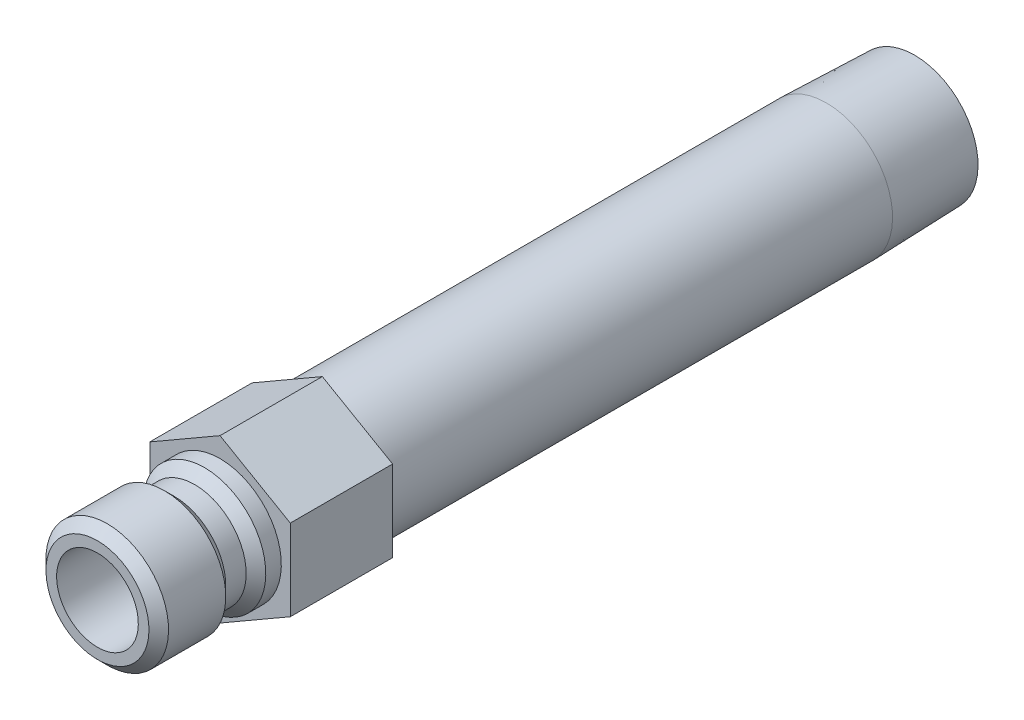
ISO-10303-21;
HEADER;
FILE_DESCRIPTION(('STEP AP214'),'2;1');
FILE_NAME('part.step','',(''),(''),'','','');
FILE_SCHEMA(('AUTOMOTIVE_DESIGN { 1 0 10303 214 1 1 1 1 }'));
ENDSEC;
DATA;
#1=APPLICATION_CONTEXT('core data for automotive mechanical design processes');
#2=APPLICATION_PROTOCOL_DEFINITION('international standard','automotive_design',2000,#1);
#3=PRODUCT_CONTEXT('',#1,'mechanical');
#4=PRODUCT('Part','Part','',(#3));
#5=PRODUCT_RELATED_PRODUCT_CATEGORY('part','',(#4));
#6=PRODUCT_DEFINITION_FORMATION('','',#4);
#7=PRODUCT_DEFINITION_CONTEXT('part definition',#1,'design');
#8=PRODUCT_DEFINITION('design','',#6,#7);
#9=PRODUCT_DEFINITION_SHAPE('','',#8);
#10=(LENGTH_UNIT() NAMED_UNIT(*) SI_UNIT(.MILLI.,.METRE.));
#11=(NAMED_UNIT(*) PLANE_ANGLE_UNIT() SI_UNIT($,.RADIAN.));
#12=(NAMED_UNIT(*) SI_UNIT($,.STERADIAN.) SOLID_ANGLE_UNIT());
#13=UNCERTAINTY_MEASURE_WITH_UNIT(LENGTH_MEASURE(1.E-05),#10,'distance_accuracy_value','');
#14=(GEOMETRIC_REPRESENTATION_CONTEXT(3) GLOBAL_UNCERTAINTY_ASSIGNED_CONTEXT((#13)) GLOBAL_UNIT_ASSIGNED_CONTEXT((#10,
#11,#12)) REPRESENTATION_CONTEXT('',''));
#15=CARTESIAN_POINT('',(0.,0.,0.));
#16=DIRECTION('',(0.,0.,1.));
#17=DIRECTION('',(1.,0.,0.));
#18=AXIS2_PLACEMENT_3D('',#15,#16,#17);
#19=CARTESIAN_POINT('',(0.,4.7625,0.));
#20=DIRECTION('',(0.,0.,1.));
#21=DIRECTION('',(0.,-1.,0.));
#22=AXIS2_PLACEMENT_3D('',#19,#20,#21);
#23=PLANE('',#22);
#24=CARTESIAN_POINT('',(0.,0.,0.));
#25=DIRECTION('',(0.,0.,-1.));
#26=DIRECTION('',(0.,1.,0.));
#27=AXIS2_PLACEMENT_3D('',#24,#25,#26);
#28=CIRCLE('',#27,4.7625);
#29=CARTESIAN_POINT('',(0.,4.7625,0.));
#30=VERTEX_POINT('',#29);
#31=EDGE_CURVE('E166',#30,#30,#28,.T.);
#32=ORIENTED_EDGE('',*,*,#31,.T.);
#33=EDGE_LOOP('',(#32));
#34=FACE_BOUND('',#33,.T.);
#35=DIRECTION('',(-0.866025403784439,-0.5,0.));
#36=VECTOR('',#35,1.);
#37=CARTESIAN_POINT('',(0.,6.3058196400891,0.));
#38=LINE('',#37,#36);
#39=CARTESIAN_POINT('',(0.,6.3058196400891,0.));
#40=VERTEX_POINT('',#39);
#41=CARTESIAN_POINT('',(-5.461,3.15290982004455,0.));
#42=VERTEX_POINT('',#41);
#43=EDGE_CURVE('E122',#40,#42,#38,.T.);
#44=ORIENTED_EDGE('',*,*,#43,.T.);
#45=DIRECTION('',(0.,-1.,0.));
#46=VECTOR('',#45,1.);
#47=CARTESIAN_POINT('',(-5.461,3.15290982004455,0.));
#48=LINE('',#47,#46);
#49=CARTESIAN_POINT('',(-5.461,-3.15290982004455,0.));
#50=VERTEX_POINT('',#49);
#51=EDGE_CURVE('E125',#42,#50,#48,.T.);
#52=ORIENTED_EDGE('',*,*,#51,.T.);
#53=DIRECTION('',(0.866025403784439,-0.5,0.));
#54=VECTOR('',#53,1.);
#55=CARTESIAN_POINT('',(-5.461,-3.15290982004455,0.));
#56=LINE('',#55,#54);
#57=CARTESIAN_POINT('',(0.,-6.30581964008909,0.));
#58=VERTEX_POINT('',#57);
#59=EDGE_CURVE('E129',#50,#58,#56,.T.);
#60=ORIENTED_EDGE('',*,*,#59,.T.);
#61=DIRECTION('',(0.866025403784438,0.5,0.));
#62=VECTOR('',#61,1.);
#63=CARTESIAN_POINT('',(0.,-6.30581964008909,0.));
#64=LINE('',#63,#62);
#65=CARTESIAN_POINT('',(5.461,-3.15290982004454,0.));
#66=VERTEX_POINT('',#65);
#67=EDGE_CURVE('E132',#58,#66,#64,.T.);
#68=ORIENTED_EDGE('',*,*,#67,.T.);
#69=DIRECTION('',(0.,1.,0.));
#70=VECTOR('',#69,1.);
#71=CARTESIAN_POINT('',(5.461,-3.15290982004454,0.));
#72=LINE('',#71,#70);
#73=CARTESIAN_POINT('',(5.461,3.15290982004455,0.));
#74=VERTEX_POINT('',#73);
#75=EDGE_CURVE('E99',#66,#74,#72,.T.);
#76=ORIENTED_EDGE('',*,*,#75,.T.);
#77=DIRECTION('',(-0.866025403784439,0.5,0.));
#78=VECTOR('',#77,1.);
#79=CARTESIAN_POINT('',(5.461,3.15290982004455,0.));
#80=LINE('',#79,#78);
#81=EDGE_CURVE('E135',#74,#40,#80,.T.);
#82=ORIENTED_EDGE('',*,*,#81,.T.);
#83=EDGE_LOOP('',(#44,#52,#60,#68,#76,#82));
#84=FACE_BOUND('',#83,.T.);
#85=ADVANCED_FACE('F33',(#34,#84),#23,.T.);
#86=CARTESIAN_POINT('',(0.,0.,0.));
#87=DIRECTION('',(0.,0.,-1.));
#88=DIRECTION('',(0.,1.,0.));
#89=AXIS2_PLACEMENT_3D('',#86,#87,#88);
#90=CYLINDRICAL_SURFACE('',#89,4.7625);
#91=CARTESIAN_POINT('',(0.,0.,1.2065));
#92=DIRECTION('',(0.,0.,-1.));
#93=DIRECTION('',(0.,1.,0.));
#94=AXIS2_PLACEMENT_3D('',#91,#92,#93);
#95=CIRCLE('',#94,4.7625);
#96=CARTESIAN_POINT('',(0.,4.7625,1.2065));
#97=VERTEX_POINT('',#96);
#98=EDGE_CURVE('E163',#97,#97,#95,.T.);
#99=ORIENTED_EDGE('',*,*,#98,.T.);
#100=EDGE_LOOP('',(#99));
#101=FACE_BOUND('',#100,.T.);
#102=ORIENTED_EDGE('',*,*,#31,.F.);
#103=EDGE_LOOP('',(#102));
#104=FACE_BOUND('',#103,.T.);
#105=ADVANCED_FACE('F192',(#101,#104),#90,.T.);
#106=CARTESIAN_POINT('',(0.,0.,1.2065));
#107=DIRECTION('',(0.,0.,-1.));
#108=DIRECTION('',(0.,1.,0.));
#109=AXIS2_PLACEMENT_3D('',#106,#107,#108);
#110=CONICAL_SURFACE('',#109,4.7625,0.785398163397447);
#111=CARTESIAN_POINT('',(0.,0.,1.9685));
#112=DIRECTION('',(0.,0.,-1.));
#113=DIRECTION('',(0.,1.,0.));
#114=AXIS2_PLACEMENT_3D('',#111,#112,#113);
#115=CIRCLE('',#114,4.0005);
#116=CARTESIAN_POINT('',(0.,4.0005,1.9685));
#117=VERTEX_POINT('',#116);
#118=EDGE_CURVE('E160',#117,#117,#115,.T.);
#119=ORIENTED_EDGE('',*,*,#118,.T.);
#120=EDGE_LOOP('',(#119));
#121=FACE_BOUND('',#120,.T.);
#122=ORIENTED_EDGE('',*,*,#98,.F.);
#123=EDGE_LOOP('',(#122));
#124=FACE_BOUND('',#123,.T.);
#125=ADVANCED_FACE('F198',(#121,#124),#110,.T.);
#126=CARTESIAN_POINT('',(0.,0.,0.));
#127=DIRECTION('',(0.,0.,-1.));
#128=DIRECTION('',(0.,1.,0.));
#129=AXIS2_PLACEMENT_3D('',#126,#127,#128);
#130=CYLINDRICAL_SURFACE('',#129,4.0005);
#131=CARTESIAN_POINT('',(0.,0.,3.556));
#132=DIRECTION('',(0.,0.,-1.));
#133=DIRECTION('',(0.,1.,0.));
#134=AXIS2_PLACEMENT_3D('',#131,#132,#133);
#135=CIRCLE('',#134,4.0005);
#136=CARTESIAN_POINT('',(0.,4.0005,3.556));
#137=VERTEX_POINT('',#136);
#138=EDGE_CURVE('E157',#137,#137,#135,.T.);
#139=ORIENTED_EDGE('',*,*,#138,.T.);
#140=EDGE_LOOP('',(#139));
#141=FACE_BOUND('',#140,.T.);
#142=ORIENTED_EDGE('',*,*,#118,.F.);
#143=EDGE_LOOP('',(#142));
#144=FACE_BOUND('',#143,.T.);
#145=ADVANCED_FACE('F258',(#141,#144),#130,.T.);
#146=CARTESIAN_POINT('',(0.,0.,3.556));
#147=DIRECTION('',(0.,0.,1.));
#148=DIRECTION('',(0.,-1.,0.));
#149=AXIS2_PLACEMENT_3D('',#146,#147,#148);
#150=CONICAL_SURFACE('',#149,4.0005,0.785398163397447);
#151=CARTESIAN_POINT('',(0.,0.,4.318));
#152=DIRECTION('',(0.,0.,-1.));
#153=DIRECTION('',(0.,1.,0.));
#154=AXIS2_PLACEMENT_3D('',#151,#152,#153);
#155=CIRCLE('',#154,4.7625);
#156=CARTESIAN_POINT('',(0.,4.7625,4.318));
#157=VERTEX_POINT('',#156);
#158=EDGE_CURVE('E154',#157,#157,#155,.T.);
#159=ORIENTED_EDGE('',*,*,#158,.T.);
#160=EDGE_LOOP('',(#159));
#161=FACE_BOUND('',#160,.T.);
#162=ORIENTED_EDGE('',*,*,#138,.F.);
#163=EDGE_LOOP('',(#162));
#164=FACE_BOUND('',#163,.T.);
#165=ADVANCED_FACE('F254',(#161,#164),#150,.T.);
#166=CARTESIAN_POINT('',(0.,0.,0.));
#167=DIRECTION('',(0.,0.,-1.));
#168=DIRECTION('',(0.,1.,0.));
#169=AXIS2_PLACEMENT_3D('',#166,#167,#168);
#170=CYLINDRICAL_SURFACE('',#169,4.7625);
#171=CARTESIAN_POINT('',(0.,0.,8.763));
#172=DIRECTION('',(0.,0.,-1.));
#173=DIRECTION('',(0.,1.,0.));
#174=AXIS2_PLACEMENT_3D('',#171,#172,#173);
#175=CIRCLE('',#174,4.7625);
#176=CARTESIAN_POINT('',(0.,4.7625,8.763));
#177=VERTEX_POINT('',#176);
#178=EDGE_CURVE('E151',#177,#177,#175,.T.);
#179=ORIENTED_EDGE('',*,*,#178,.T.);
#180=EDGE_LOOP('',(#179));
#181=FACE_BOUND('',#180,.T.);
#182=ORIENTED_EDGE('',*,*,#158,.F.);
#183=EDGE_LOOP('',(#182));
#184=FACE_BOUND('',#183,.T.);
#185=ADVANCED_FACE('F250',(#181,#184),#170,.T.);
#186=CARTESIAN_POINT('',(0.,0.,8.763));
#187=DIRECTION('',(0.,0.,-1.));
#188=DIRECTION('',(0.,1.,0.));
#189=AXIS2_PLACEMENT_3D('',#186,#187,#188);
#190=CONICAL_SURFACE('',#189,4.7625,0.785398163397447);
#191=CARTESIAN_POINT('',(0.,0.,9.525));
#192=DIRECTION('',(0.,0.,-1.));
#193=DIRECTION('',(0.,1.,0.));
#194=AXIS2_PLACEMENT_3D('',#191,#192,#193);
#195=CIRCLE('',#194,4.0005);
#196=CARTESIAN_POINT('',(0.,4.0005,9.525));
#197=VERTEX_POINT('',#196);
#198=EDGE_CURVE('E148',#197,#197,#195,.T.);
#199=ORIENTED_EDGE('',*,*,#198,.T.);
#200=EDGE_LOOP('',(#199));
#201=FACE_BOUND('',#200,.T.);
#202=ORIENTED_EDGE('',*,*,#178,.F.);
#203=EDGE_LOOP('',(#202));
#204=FACE_BOUND('',#203,.T.);
#205=ADVANCED_FACE('F246',(#201,#204),#190,.T.);
#206=CARTESIAN_POINT('',(0.,3.175,9.525));
#207=DIRECTION('',(0.,0.,1.));
#208=DIRECTION('',(0.,-1.,0.));
#209=AXIS2_PLACEMENT_3D('',#206,#207,#208);
#210=PLANE('',#209);
#211=CARTESIAN_POINT('',(0.,0.,9.525));
#212=DIRECTION('',(0.,0.,-1.));
#213=DIRECTION('',(0.,1.,0.));
#214=AXIS2_PLACEMENT_3D('',#211,#212,#213);
#215=CIRCLE('',#214,3.175);
#216=CARTESIAN_POINT('',(0.,3.175,9.525));
#217=VERTEX_POINT('',#216);
#218=EDGE_CURVE('E145',#217,#217,#215,.T.);
#219=ORIENTED_EDGE('',*,*,#218,.T.);
#220=EDGE_LOOP('',(#219));
#221=FACE_BOUND('',#220,.T.);
#222=ORIENTED_EDGE('',*,*,#198,.F.);
#223=EDGE_LOOP('',(#222));
#224=FACE_BOUND('',#223,.T.);
#225=ADVANCED_FACE('F242',(#221,#224),#210,.T.);
#226=CARTESIAN_POINT('',(0.,0.,0.));
#227=DIRECTION('',(0.,0.,-1.));
#228=DIRECTION('',(0.,1.,0.));
#229=AXIS2_PLACEMENT_3D('',#226,#227,#228);
#230=CYLINDRICAL_SURFACE('',#229,3.175);
#231=CARTESIAN_POINT('',(0.,0.,0.));
#232=DIRECTION('',(0.,0.,1.));
#233=DIRECTION('',(1.,0.,0.));
#234=AXIS2_PLACEMENT_3D('',#231,#232,#233);
#235=CIRCLE('',#234,3.175);
#236=CARTESIAN_POINT('',(3.175,0.,0.));
#237=VERTEX_POINT('',#236);
#238=EDGE_CURVE('E11',#237,#237,#235,.T.);
#239=ORIENTED_EDGE('',*,*,#238,.F.);
#240=EDGE_LOOP('',(#239));
#241=FACE_BOUND('',#240,.T.);
#242=ORIENTED_EDGE('',*,*,#218,.F.);
#243=EDGE_LOOP('',(#242));
#244=FACE_BOUND('',#243,.T.);
#245=ADVANCED_FACE('F226',(#241,#244),#230,.F.);
#246=CARTESIAN_POINT('',(-5.461,3.15290982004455,0.));
#247=DIRECTION('',(0.,0.,1.));
#248=DIRECTION('',(1.,0.,0.));
#249=AXIS2_PLACEMENT_3D('',#246,#247,#248);
#250=PLANE('',#249);
#251=ORIENTED_EDGE('',*,*,#238,.T.);
#252=EDGE_LOOP('',(#251));
#253=FACE_BOUND('',#252,.T.);
#254=CARTESIAN_POINT('',(0.,0.,0.));
#255=DIRECTION('',(0.,0.,1.));
#256=DIRECTION('',(1.,0.,0.));
#257=AXIS2_PLACEMENT_3D('',#254,#255,#256);
#258=CIRCLE('',#257,2.38124999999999);
#259=CARTESIAN_POINT('',(2.38124999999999,0.,0.));
#260=VERTEX_POINT('',#259);
#261=EDGE_CURVE('E126',#260,#260,#258,.T.);
#262=ORIENTED_EDGE('',*,*,#261,.F.);
#263=EDGE_LOOP('',(#262));
#264=FACE_BOUND('',#263,.T.);
#265=ADVANCED_FACE('F222',(#253,#264),#250,.T.);
#266=CARTESIAN_POINT('',(0.,6.3058196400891,-7.9502));
#267=DIRECTION('',(-0.5,0.866025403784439,0.));
#268=DIRECTION('',(-0.866025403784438,-0.5,0.));
#269=AXIS2_PLACEMENT_3D('',#266,#267,#268);
#270=PLANE('',#269);
#271=ORIENTED_EDGE('',*,*,#43,.F.);
#272=DIRECTION('',(0.,0.,1.));
#273=VECTOR('',#272,1.);
#274=CARTESIAN_POINT('',(0.,6.3058196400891,-7.9502));
#275=LINE('',#274,#273);
#276=CARTESIAN_POINT('',(0.,6.3058196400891,-7.9502));
#277=VERTEX_POINT('',#276);
#278=EDGE_CURVE('E51',#277,#40,#275,.T.);
#279=ORIENTED_EDGE('',*,*,#278,.F.);
#280=DIRECTION('',(-0.866025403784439,-0.5,0.));
#281=VECTOR('',#280,1.);
#282=CARTESIAN_POINT('',(0.,6.3058196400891,-7.9502));
#283=LINE('',#282,#281);
#284=CARTESIAN_POINT('',(-5.461,3.15290982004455,-7.9502));
#285=VERTEX_POINT('',#284);
#286=EDGE_CURVE('E138',#277,#285,#283,.T.);
#287=ORIENTED_EDGE('',*,*,#286,.T.);
#288=DIRECTION('',(0.,0.,1.));
#289=VECTOR('',#288,1.);
#290=CARTESIAN_POINT('',(-5.461,3.15290982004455,-7.9502));
#291=LINE('',#290,#289);
#292=EDGE_CURVE('E86',#285,#42,#291,.T.);
#293=ORIENTED_EDGE('',*,*,#292,.T.);
#294=EDGE_LOOP('',(#271,#279,#287,#293));
#295=FACE_BOUND('',#294,.T.);
#296=ADVANCED_FACE('F225',(#295),#270,.T.);
#297=CARTESIAN_POINT('',(5.461,3.15290982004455,-7.9502));
#298=DIRECTION('',(0.5,0.866025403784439,0.));
#299=DIRECTION('',(-0.866025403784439,0.5,0.));
#300=AXIS2_PLACEMENT_3D('',#297,#298,#299);
#301=PLANE('',#300);
#302=ORIENTED_EDGE('',*,*,#81,.F.);
#303=DIRECTION('',(0.,0.,1.));
#304=VECTOR('',#303,1.);
#305=CARTESIAN_POINT('',(5.461,3.15290982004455,-7.9502));
#306=LINE('',#305,#304);
#307=CARTESIAN_POINT('',(5.461,3.15290982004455,-7.9502));
#308=VERTEX_POINT('',#307);
#309=EDGE_CURVE('E74',#308,#74,#306,.T.);
#310=ORIENTED_EDGE('',*,*,#309,.F.);
#311=DIRECTION('',(-0.866025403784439,0.5,0.));
#312=VECTOR('',#311,1.);
#313=CARTESIAN_POINT('',(5.461,3.15290982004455,-7.9502));
#314=LINE('',#313,#312);
#315=EDGE_CURVE('E112',#308,#277,#314,.T.);
#316=ORIENTED_EDGE('',*,*,#315,.T.);
#317=ORIENTED_EDGE('',*,*,#278,.T.);
#318=EDGE_LOOP('',(#302,#310,#316,#317));
#319=FACE_BOUND('',#318,.T.);
#320=ADVANCED_FACE('F228',(#319),#301,.T.);
#321=CARTESIAN_POINT('',(5.461,-3.15290982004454,-7.9502));
#322=DIRECTION('',(1.,0.,0.));
#323=DIRECTION('',(0.,1.,0.));
#324=AXIS2_PLACEMENT_3D('',#321,#322,#323);
#325=PLANE('',#324);
#326=ORIENTED_EDGE('',*,*,#75,.F.);
#327=DIRECTION('',(0.,0.,1.));
#328=VECTOR('',#327,1.);
#329=CARTESIAN_POINT('',(5.461,-3.15290982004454,-7.9502));
#330=LINE('',#329,#328);
#331=CARTESIAN_POINT('',(5.461,-3.15290982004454,-7.9502));
#332=VERTEX_POINT('',#331);
#333=EDGE_CURVE('E94',#332,#66,#330,.T.);
#334=ORIENTED_EDGE('',*,*,#333,.F.);
#335=DIRECTION('',(0.,1.,0.));
#336=VECTOR('',#335,1.);
#337=CARTESIAN_POINT('',(5.461,-3.15290982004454,-7.9502));
#338=LINE('',#337,#336);
#339=EDGE_CURVE('E97',#332,#308,#338,.T.);
#340=ORIENTED_EDGE('',*,*,#339,.T.);
#341=ORIENTED_EDGE('',*,*,#309,.T.);
#342=EDGE_LOOP('',(#326,#334,#340,#341));
#343=FACE_BOUND('',#342,.T.);
#344=ADVANCED_FACE('F96',(#343),#325,.T.);
#345=CARTESIAN_POINT('',(0.,-6.30581964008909,-7.9502));
#346=DIRECTION('',(0.5,-0.866025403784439,0.));
#347=DIRECTION('',(0.866025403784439,0.5,0.));
#348=AXIS2_PLACEMENT_3D('',#345,#346,#347);
#349=PLANE('',#348);
#350=ORIENTED_EDGE('',*,*,#67,.F.);
#351=DIRECTION('',(0.,0.,1.));
#352=VECTOR('',#351,1.);
#353=CARTESIAN_POINT('',(0.,-6.30581964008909,-7.9502));
#354=LINE('',#353,#352);
#355=CARTESIAN_POINT('',(0.,-6.30581964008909,-7.9502));
#356=VERTEX_POINT('',#355);
#357=EDGE_CURVE('E104',#356,#58,#354,.T.);
#358=ORIENTED_EDGE('',*,*,#357,.F.);
#359=DIRECTION('',(0.866025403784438,0.5,0.));
#360=VECTOR('',#359,1.);
#361=CARTESIAN_POINT('',(0.,-6.30581964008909,-7.9502));
#362=LINE('',#361,#360);
#363=EDGE_CURVE('E110',#356,#332,#362,.T.);
#364=ORIENTED_EDGE('',*,*,#363,.T.);
#365=ORIENTED_EDGE('',*,*,#333,.T.);
#366=EDGE_LOOP('',(#350,#358,#364,#365));
#367=FACE_BOUND('',#366,.T.);
#368=ADVANCED_FACE('F114',(#367),#349,.T.);
#369=CARTESIAN_POINT('',(-5.461,-3.15290982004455,-7.9502));
#370=DIRECTION('',(-0.5,-0.866025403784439,0.));
#371=DIRECTION('',(0.866025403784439,-0.5,0.));
#372=AXIS2_PLACEMENT_3D('',#369,#370,#371);
#373=PLANE('',#372);
#374=ORIENTED_EDGE('',*,*,#59,.F.);
#375=DIRECTION('',(0.,0.,1.));
#376=VECTOR('',#375,1.);
#377=CARTESIAN_POINT('',(-5.461,-3.15290982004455,-7.9502));
#378=LINE('',#377,#376);
#379=CARTESIAN_POINT('',(-5.461,-3.15290982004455,-7.9502));
#380=VERTEX_POINT('',#379);
#381=EDGE_CURVE('E142',#380,#50,#378,.T.);
#382=ORIENTED_EDGE('',*,*,#381,.F.);
#383=DIRECTION('',(0.866025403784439,-0.5,0.));
#384=VECTOR('',#383,1.);
#385=CARTESIAN_POINT('',(-5.461,-3.15290982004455,-7.9502));
#386=LINE('',#385,#384);
#387=EDGE_CURVE('E115',#380,#356,#386,.T.);
#388=ORIENTED_EDGE('',*,*,#387,.T.);
#389=ORIENTED_EDGE('',*,*,#357,.T.);
#390=EDGE_LOOP('',(#374,#382,#388,#389));
#391=FACE_BOUND('',#390,.T.);
#392=ADVANCED_FACE('F219',(#391),#373,.T.);
#393=CARTESIAN_POINT('',(-5.461,3.15290982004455,-7.9502));
#394=DIRECTION('',(-1.,0.,0.));
#395=DIRECTION('',(0.,0.,1.));
#396=AXIS2_PLACEMENT_3D('',#393,#394,#395);
#397=PLANE('',#396);
#398=ORIENTED_EDGE('',*,*,#51,.F.);
#399=ORIENTED_EDGE('',*,*,#292,.F.);
#400=DIRECTION('',(0.,-1.,0.));
#401=VECTOR('',#400,1.);
#402=CARTESIAN_POINT('',(-5.461,3.15290982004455,-7.9502));
#403=LINE('',#402,#401);
#404=EDGE_CURVE('E117',#285,#380,#403,.T.);
#405=ORIENTED_EDGE('',*,*,#404,.T.);
#406=ORIENTED_EDGE('',*,*,#381,.T.);
#407=EDGE_LOOP('',(#398,#399,#405,#406));
#408=FACE_BOUND('',#407,.T.);
#409=ADVANCED_FACE('F214',(#408),#397,.T.);
#410=CARTESIAN_POINT('',(-5.461,3.15290982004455,-7.9502));
#411=DIRECTION('',(0.,0.,1.));
#412=DIRECTION('',(1.,0.,0.));
#413=AXIS2_PLACEMENT_3D('',#410,#411,#412);
#414=PLANE('',#413);
#415=CARTESIAN_POINT('',(0.,0.,-7.9502));
#416=DIRECTION('',(0.,0.,1.));
#417=DIRECTION('',(1.,0.,0.));
#418=AXIS2_PLACEMENT_3D('',#415,#416,#417);
#419=CIRCLE('',#418,5.1435);
#420=CARTESIAN_POINT('',(5.1435,0.,-7.9502));
#421=VERTEX_POINT('',#420);
#422=EDGE_CURVE('E37',#421,#421,#419,.F.);
#423=ORIENTED_EDGE('',*,*,#422,.F.);
#424=EDGE_LOOP('',(#423));
#425=FACE_BOUND('',#424,.T.);
#426=ORIENTED_EDGE('',*,*,#286,.F.);
#427=ORIENTED_EDGE('',*,*,#315,.F.);
#428=ORIENTED_EDGE('',*,*,#339,.F.);
#429=ORIENTED_EDGE('',*,*,#363,.F.);
#430=ORIENTED_EDGE('',*,*,#387,.F.);
#431=ORIENTED_EDGE('',*,*,#404,.F.);
#432=EDGE_LOOP('',(#426,#427,#428,#429,#430,#431));
#433=FACE_BOUND('',#432,.T.);
#434=ADVANCED_FACE('F108',(#425,#433),#414,.F.);
#435=CARTESIAN_POINT('',(0.,0.,0.));
#436=DIRECTION('',(0.,0.,-1.));
#437=DIRECTION('',(0.,1.,0.));
#438=AXIS2_PLACEMENT_3D('',#435,#436,#437);
#439=CYLINDRICAL_SURFACE('',#438,2.38125);
#440=CARTESIAN_POINT('',(0.,0.,-53.975));
#441=DIRECTION('',(0.,0.,-1.));
#442=DIRECTION('',(0.,1.,0.));
#443=AXIS2_PLACEMENT_3D('',#440,#441,#442);
#444=CIRCLE('',#443,2.38124999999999);
#445=CARTESIAN_POINT('',(0.,2.38125,-53.975));
#446=VERTEX_POINT('',#445);
#447=EDGE_CURVE('E43',#446,#446,#444,.T.);
#448=ORIENTED_EDGE('',*,*,#447,.T.);
#449=EDGE_LOOP('',(#448));
#450=FACE_BOUND('',#449,.T.);
#451=ORIENTED_EDGE('',*,*,#261,.T.);
#452=EDGE_LOOP('',(#451));
#453=FACE_BOUND('',#452,.T.);
#454=ADVANCED_FACE('F35',(#450,#453),#439,.F.);
#455=CARTESIAN_POINT('',(0.,4.9291887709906,-53.975));
#456=DIRECTION('',(0.,0.,-1.));
#457=DIRECTION('',(0.,1.,0.));
#458=AXIS2_PLACEMENT_3D('',#455,#456,#457);
#459=PLANE('',#458);
#460=CARTESIAN_POINT('',(0.,0.,-53.975));
#461=DIRECTION('',(0.,0.,-1.));
#462=DIRECTION('',(0.,1.,0.));
#463=AXIS2_PLACEMENT_3D('',#460,#461,#462);
#464=CIRCLE('',#463,4.9291887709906);
#465=CARTESIAN_POINT('',(0.,4.9291887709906,-53.975));
#466=VERTEX_POINT('',#465);
#467=EDGE_CURVE('E172',#466,#466,#464,.T.);
#468=ORIENTED_EDGE('',*,*,#467,.T.);
#469=EDGE_LOOP('',(#468));
#470=FACE_BOUND('',#469,.T.);
#471=ORIENTED_EDGE('',*,*,#447,.F.);
#472=EDGE_LOOP('',(#471));
#473=FACE_BOUND('',#472,.T.);
#474=ADVANCED_FACE('F180',(#470,#473),#459,.T.);
#475=CARTESIAN_POINT('',(0.,0.,-53.975));
#476=DIRECTION('',(0.,0.,1.));
#477=DIRECTION('',(0.,-1.,0.));
#478=AXIS2_PLACEMENT_3D('',#475,#476,#477);
#479=CONICAL_SURFACE('',#478,4.9291887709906,0.0312396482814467);
#480=CARTESIAN_POINT('',(0.,0.,-47.117));
#481=DIRECTION('',(0.,0.,-1.));
#482=DIRECTION('',(0.,1.,0.));
#483=AXIS2_PLACEMENT_3D('',#480,#481,#482);
#484=CIRCLE('',#483,5.14349999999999);
#485=CARTESIAN_POINT('',(0.,5.1435,-47.117));
#486=VERTEX_POINT('',#485);
#487=EDGE_CURVE('E169',#486,#486,#484,.T.);
#488=ORIENTED_EDGE('',*,*,#487,.T.);
#489=EDGE_LOOP('',(#488));
#490=FACE_BOUND('',#489,.T.);
#491=ORIENTED_EDGE('',*,*,#467,.F.);
#492=EDGE_LOOP('',(#491));
#493=FACE_BOUND('',#492,.T.);
#494=ADVANCED_FACE('F182',(#490,#493),#479,.T.);
#495=CARTESIAN_POINT('',(0.,0.,0.));
#496=DIRECTION('',(0.,0.,-1.));
#497=DIRECTION('',(0.,1.,0.));
#498=AXIS2_PLACEMENT_3D('',#495,#496,#497);
#499=CYLINDRICAL_SURFACE('',#498,5.1435);
#500=ORIENTED_EDGE('',*,*,#487,.F.);
#501=EDGE_LOOP('',(#500));
#502=FACE_BOUND('',#501,.T.);
#503=ORIENTED_EDGE('',*,*,#422,.T.);
#504=EDGE_LOOP('',(#503));
#505=FACE_BOUND('',#504,.T.);
#506=ADVANCED_FACE('F188',(#502,#505),#499,.T.);
#507=CLOSED_SHELL('',(#85,#105,#125,#145,#165,#185,#205,#225,#245,#265,#296,#320,#344,#368,#392,
#409,#434,#454,#474,#494,#506));
#508=MANIFOLD_SOLID_BREP('B2',#507);
#509=ADVANCED_BREP_SHAPE_REPRESENTATION('',(#18,#508),#14);
#510=SHAPE_DEFINITION_REPRESENTATION(#9,#509);
ENDSEC;
END-ISO-10303-21;
